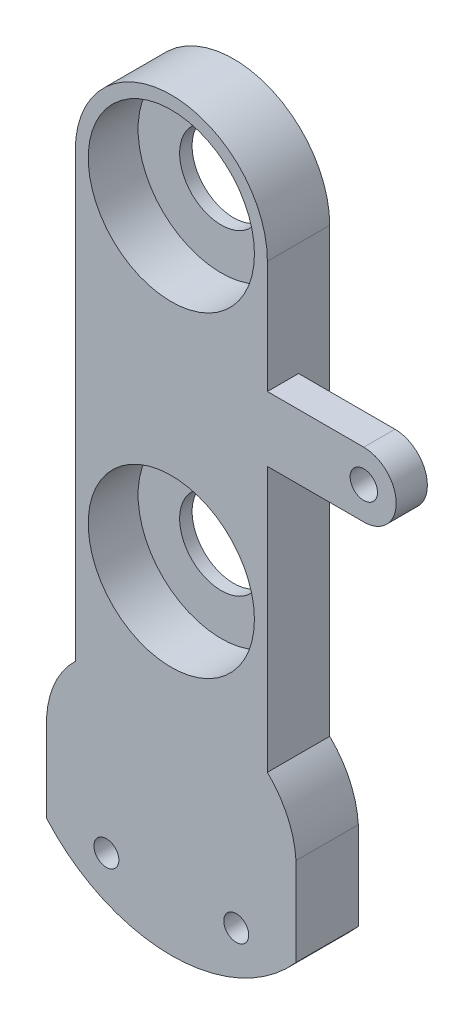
from build123d import *

# Parameters (mm, degrees)
SKETCH2_R           = 2.999999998
BOSS_EXTRUDE5_DEPTH = 15
SKETCH3_R           = 20
CUT_EXTRUDE1_DEPTH  = 12
SKETCH4_R           = 10
CUT_EXTRUDE2_DEPTH  = 15
CUT_EXTRUDE3_START  = -15
CUT_EXTRUDE3_DEPTH  = 7.5
SKETCH8_R           = 3.3
CUT_EXTRUDE4_DEPTH  = 187.088915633


with BuildPart() as part:
    # Sketch2 → Boss-Extrude5 (new body)
    with BuildSketch(Plane.XY):
        with BuildLine():
            Line((0, 21.234591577), (0, 0))
            ThreePointArc((0, 0), (30.006144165, -13.549455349), (60.01228833, 0))
            Line((60.01228833, 0), (60.01228833, 21.234591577))
            ThreePointArc((60.01228833, 21.234591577), (57.97724846, 29.360841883), (53.126816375, 36.190969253))
            Line((53.126816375, 36.190969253), (53.126816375, 99.956409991))
            Line((53.126816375, 99.956409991), (76.325635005, 99.956409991))
            ThreePointArc((76.325635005, 99.956409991), (84.122810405, 107.753585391), (76.325635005, 115.550760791))
            Line((76.325635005, 115.550760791), (53.126816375, 115.557729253))
            Line((53.126816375, 115.557729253), (53.126816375, 142.699071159))
            ThreePointArc((53.126816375, 142.699071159), (30.006144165, 165.819743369), (6.885471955, 142.699071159))
            Line((6.885471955, 142.699071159), (6.885471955, 36.190969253))
            ThreePointArc((6.885471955, 36.190969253), (2.03503987, 29.360841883), (0, 21.234591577))
        make_face()
        with Locations((14.381144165, 0)):
            Circle(SKETCH2_R, mode=Mode.SUBTRACT)
        with Locations(Location((45.631144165, 0, 0), (0, 0, 180))):
            Circle(SKETCH2_R, mode=Mode.SUBTRACT)
    extrude(amount=BOSS_EXTRUDE5_DEPTH)

    # Sketch3 → Cut-Extrude1 (cut)
    with BuildSketch(Plane.XY.offset(15)):
        with Locations((30.006144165, 142.699071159)):
            Circle(SKETCH3_R)
        with Locations((30.006144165, 66.499071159)):
            Circle(SKETCH3_R)
    extrude(amount=-CUT_EXTRUDE1_DEPTH, mode=Mode.SUBTRACT)

    # Sketch4 → Cut-Extrude2 (cut)
    with BuildSketch(Plane.XY.offset(15)):
        with Locations((30.006144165, 142.699071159)):
            Circle(SKETCH4_R)
        with Locations((30.006144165, 66.499071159)):
            Circle(SKETCH4_R)
    extrude(amount=-CUT_EXTRUDE2_DEPTH, mode=Mode.SUBTRACT)

    # Sketch6 → Cut-Extrude3 (cut)
    with BuildSketch(Plane.XY.offset(15).offset(CUT_EXTRUDE3_START)):
        with BuildLine():
            Line((76.325635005, 115.550760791), (53.126816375, 115.557729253))
            Line((53.126816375, 115.557729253), (53.126816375, 99.956409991))
            Line((53.126816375, 99.956409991), (76.325635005, 99.956409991))
            ThreePointArc((76.325635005, 99.956409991), (84.122810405, 107.753585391), (76.325635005, 115.550760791))
        make_face()
    extrude(amount=CUT_EXTRUDE3_DEPTH, mode=Mode.SUBTRACT)

    # Sketch8 → Cut-Extrude4 (cut, through all)
    with BuildSketch(Plane(origin=(0, 0, 7.5), x_dir=(-1, 0, 0), z_dir=(0, 0, -1))):
        with Locations((-76.325635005, 107.753585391)):
            Circle(SKETCH8_R)
    extrude(amount=-CUT_EXTRUDE4_DEPTH, mode=Mode.SUBTRACT)


solid = part.part
